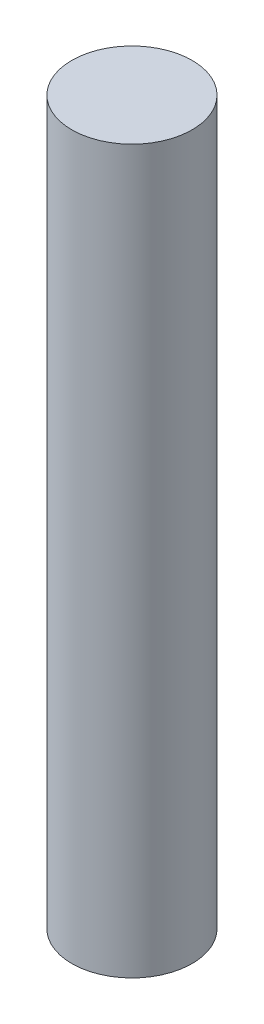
from build123d import *

# Parameters (mm, degrees)
ESQUISSE1_W = 12.5
ESQUISSE1_H = 150


with BuildPart() as part:
    # Esquisse1 → R_volution1 (revolve)
    with BuildSketch(Plane.XY, mode=Mode.PRIVATE) as r_volution1_sk:
        with Locations((6.25, 44.822044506)):
            Rectangle(ESQUISSE1_W, ESQUISSE1_H)
    revolve(r_volution1_sk.sketch.rotate(Axis((0, 119.822044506, 0), (0, -1, 0)), 180), axis=Axis((0, 119.822044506, 0), (0, -1, 0)))


solid = part.part
